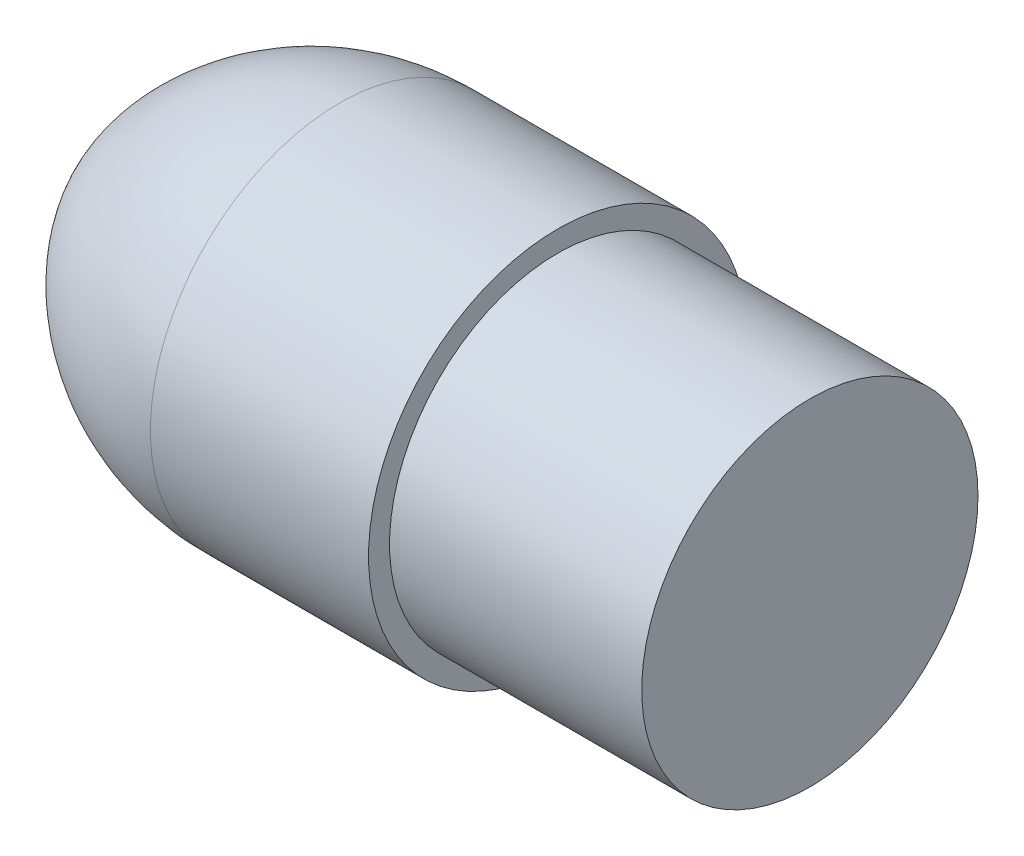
ISO-10303-21;
HEADER;
FILE_DESCRIPTION(('STEP AP214'),'2;1');
FILE_NAME('part.step','',(''),(''),'','','');
FILE_SCHEMA(('AUTOMOTIVE_DESIGN { 1 0 10303 214 1 1 1 1 }'));
ENDSEC;
DATA;
#1=APPLICATION_CONTEXT('core data for automotive mechanical design processes');
#2=APPLICATION_PROTOCOL_DEFINITION('international standard','automotive_design',2000,#1);
#3=PRODUCT_CONTEXT('',#1,'mechanical');
#4=PRODUCT('Part','Part','',(#3));
#5=PRODUCT_RELATED_PRODUCT_CATEGORY('part','',(#4));
#6=PRODUCT_DEFINITION_FORMATION('','',#4);
#7=PRODUCT_DEFINITION_CONTEXT('part definition',#1,'design');
#8=PRODUCT_DEFINITION('design','',#6,#7);
#9=PRODUCT_DEFINITION_SHAPE('','',#8);
#10=(LENGTH_UNIT() NAMED_UNIT(*) SI_UNIT(.MILLI.,.METRE.));
#11=(NAMED_UNIT(*) PLANE_ANGLE_UNIT() SI_UNIT($,.RADIAN.));
#12=(NAMED_UNIT(*) SI_UNIT($,.STERADIAN.) SOLID_ANGLE_UNIT());
#13=UNCERTAINTY_MEASURE_WITH_UNIT(LENGTH_MEASURE(1.E-05),#10,'distance_accuracy_value','');
#14=(GEOMETRIC_REPRESENTATION_CONTEXT(3) GLOBAL_UNCERTAINTY_ASSIGNED_CONTEXT((#13)) GLOBAL_UNIT_ASSIGNED_CONTEXT((#10,
#11,#12)) REPRESENTATION_CONTEXT('',''));
#15=CARTESIAN_POINT('',(0.,0.,0.));
#16=DIRECTION('',(0.,0.,1.));
#17=DIRECTION('',(1.,0.,0.));
#18=AXIS2_PLACEMENT_3D('',#15,#16,#17);
#19=CARTESIAN_POINT('',(0.,0.,0.));
#20=DIRECTION('',(1.,0.,0.));
#21=DIRECTION('',(0.,0.,-1.));
#22=AXIS2_PLACEMENT_3D('',#19,#20,#21);
#23=PLANE('',#22);
#24=CARTESIAN_POINT('',(0.,0.,0.));
#25=DIRECTION('',(1.,0.,0.));
#26=DIRECTION('',(0.,0.,-1.));
#27=AXIS2_PLACEMENT_3D('',#24,#25,#26);
#28=CIRCLE('',#27,2.54);
#29=CARTESIAN_POINT('',(0.,0.,-2.54));
#30=VERTEX_POINT('',#29);
#31=EDGE_CURVE('E11',#30,#30,#28,.T.);
#32=ORIENTED_EDGE('',*,*,#31,.T.);
#33=EDGE_LOOP('',(#32));
#34=FACE_BOUND('',#33,.T.);
#35=ADVANCED_FACE('F33',(#34),#23,.T.);
#36=CARTESIAN_POINT('',(4.94345243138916,0.,0.));
#37=DIRECTION('',(1.,0.,0.));
#38=DIRECTION('',(0.,0.,-1.));
#39=AXIS2_PLACEMENT_3D('',#36,#37,#38);
#40=CYLINDRICAL_SURFACE('',#39,2.54);
#41=CARTESIAN_POINT('',(-3.81,0.,0.));
#42=DIRECTION('',(1.,0.,0.));
#43=DIRECTION('',(0.,0.,-1.));
#44=AXIS2_PLACEMENT_3D('',#41,#42,#43);
#45=CIRCLE('',#44,2.54);
#46=CARTESIAN_POINT('',(-3.81,0.,-2.54));
#47=VERTEX_POINT('',#46);
#48=EDGE_CURVE('E39',#47,#47,#45,.T.);
#49=ORIENTED_EDGE('',*,*,#48,.T.);
#50=EDGE_LOOP('',(#49));
#51=FACE_BOUND('',#50,.T.);
#52=ORIENTED_EDGE('',*,*,#31,.F.);
#53=EDGE_LOOP('',(#52));
#54=FACE_BOUND('',#53,.T.);
#55=ADVANCED_FACE('F58',(#51,#54),#40,.T.);
#56=CARTESIAN_POINT('',(-3.81,2.54,0.));
#57=DIRECTION('',(1.,0.,0.));
#58=DIRECTION('',(0.,0.,-1.));
#59=AXIS2_PLACEMENT_3D('',#56,#57,#58);
#60=PLANE('',#59);
#61=CARTESIAN_POINT('',(-3.81,0.,0.));
#62=DIRECTION('',(1.,0.,0.));
#63=DIRECTION('',(0.,0.,-1.));
#64=AXIS2_PLACEMENT_3D('',#61,#62,#63);
#65=CIRCLE('',#64,2.8575);
#66=CARTESIAN_POINT('',(-3.81,0.,-2.8575));
#67=VERTEX_POINT('',#66);
#68=EDGE_CURVE('E51',#67,#67,#65,.T.);
#69=ORIENTED_EDGE('',*,*,#68,.T.);
#70=EDGE_LOOP('',(#69));
#71=FACE_BOUND('',#70,.T.);
#72=ORIENTED_EDGE('',*,*,#48,.F.);
#73=EDGE_LOOP('',(#72));
#74=FACE_BOUND('',#73,.T.);
#75=ADVANCED_FACE('F61',(#71,#74),#60,.T.);
#76=CARTESIAN_POINT('',(4.94345243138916,0.,0.));
#77=DIRECTION('',(1.,0.,0.));
#78=DIRECTION('',(0.,0.,-1.));
#79=AXIS2_PLACEMENT_3D('',#76,#77,#78);
#80=CYLINDRICAL_SURFACE('',#79,2.8575);
#81=CARTESIAN_POINT('',(-7.10598336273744,0.,0.));
#82=DIRECTION('',(1.,0.,0.));
#83=DIRECTION('',(0.,0.,-1.));
#84=AXIS2_PLACEMENT_3D('',#81,#82,#83);
#85=CIRCLE('',#84,2.8575);
#86=CARTESIAN_POINT('',(-7.10598336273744,0.,-2.8575));
#87=VERTEX_POINT('',#86);
#88=EDGE_CURVE('E49',#87,#87,#85,.T.);
#89=ORIENTED_EDGE('',*,*,#88,.T.);
#90=EDGE_LOOP('',(#89));
#91=FACE_BOUND('',#90,.T.);
#92=ORIENTED_EDGE('',*,*,#68,.F.);
#93=EDGE_LOOP('',(#92));
#94=FACE_BOUND('',#93,.T.);
#95=ADVANCED_FACE('F45',(#91,#94),#80,.T.);
#96=CARTESIAN_POINT('',(-7.10598336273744,0.,0.952500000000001));
#97=DIRECTION('',(0.,-1.,0.));
#98=DIRECTION('',(0.,0.,-1.));
#99=AXIS2_PLACEMENT_3D('',#96,#97,#98);
#100=CIRCLE('',#99,3.81);
#101=TRIMMED_CURVE('',#100,(PARAMETER_VALUE(-1.31811607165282)),
(PARAMETER_VALUE(1.31811607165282)),.T.,.PARAMETER.);
#102=CARTESIAN_POINT('',(-7.10598336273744,0.,0.));
#103=DIRECTION('',(1.,0.,0.));
#104=AXIS1_PLACEMENT('',#102,#103);
#105=SURFACE_OF_REVOLUTION('',#101,#104);
#106=CARTESIAN_POINT('',(-10.795,0.,0.));
#107=VERTEX_POINT('',#106);
#108=VERTEX_LOOP('',#107);
#109=FACE_BOUND('',#108,.T.);
#110=ORIENTED_EDGE('',*,*,#88,.F.);
#111=EDGE_LOOP('',(#110));
#112=FACE_BOUND('',#111,.T.);
#113=ADVANCED_FACE('F42',(#109,#112),#105,.T.);
#114=CLOSED_SHELL('',(#35,#55,#75,#95,#113));
#115=MANIFOLD_SOLID_BREP('B2',#114);
#116=ADVANCED_BREP_SHAPE_REPRESENTATION('',(#18,#115),#14);
#117=SHAPE_DEFINITION_REPRESENTATION(#9,#116);
ENDSEC;
END-ISO-10303-21;
